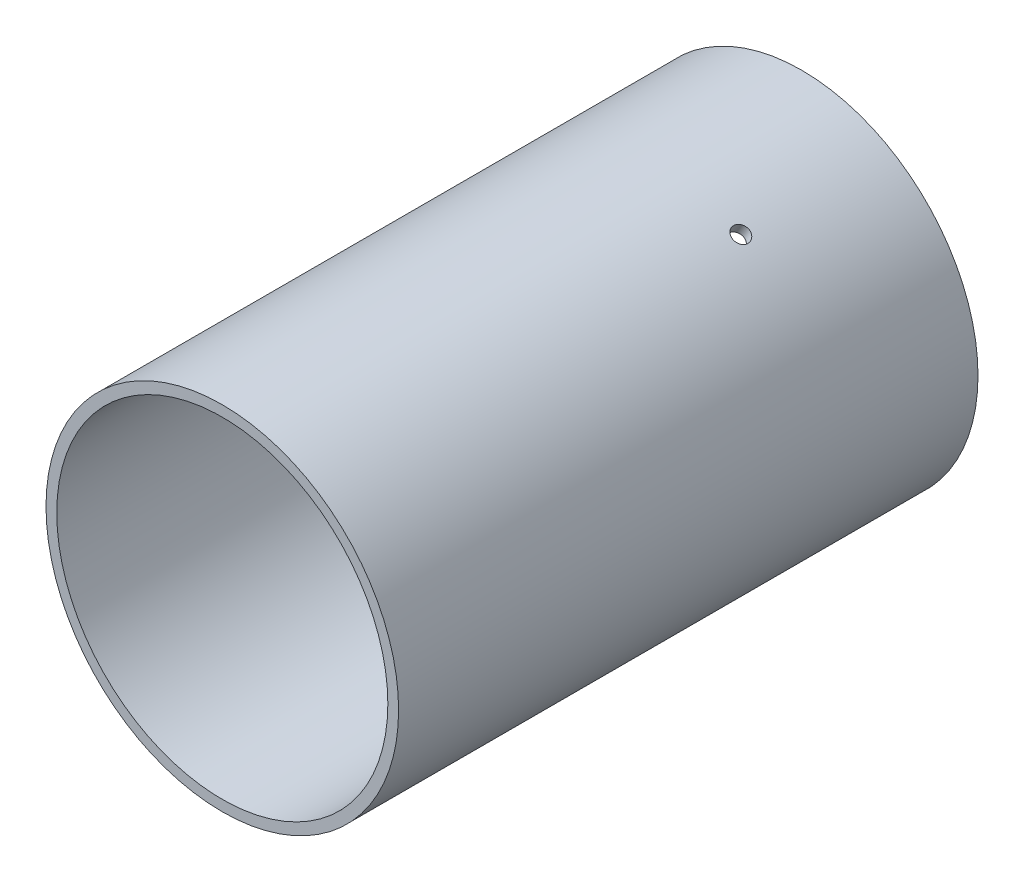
from build123d import *

# Parameters (mm, degrees)
SKETCH1_R          = 27.051
SKETCH1_R_2        = 25.4
EXTRUDE1_DEPTH     = 88.9
SKETCH2_R          = 1.27
CUT_EXTRUDE1_DEPTH = 97.781833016
SKETCH7_R          = 1.27
CUT_EXTRUDE2_DEPTH = 97.781833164
SKETCH8_R          = 1.27
CUT_EXTRUDE3_DEPTH = 97.781833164


with BuildPart() as part:
    # Sketch1 → Extrude1 (new body)
    with BuildSketch(Plane.XY):
        Circle(SKETCH1_R)
        Circle(SKETCH1_R_2, mode=Mode.SUBTRACT)
    extrude(amount=EXTRUDE1_DEPTH)

    # Sketch2 → Cut-Extrude1 (cut, through all)
    with BuildSketch(Plane(origin=(0, 0, 0), x_dir=(0, 0, -1), z_dir=(1, 0, 0))):
        with Locations((-22.86, 0)):
            Circle(SKETCH2_R)
    extrude(amount=-CUT_EXTRUDE1_DEPTH, mode=Mode.SUBTRACT)

    # Sketch7 → Cut-Extrude2 (cut, through all)
    with BuildSketch(Plane(origin=(0, 0, 0), x_dir=(-0.8660254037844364, -0.5000000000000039, 0), z_dir=(-0.5000000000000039, 0.8660254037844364, 0))):
        with Locations((0, 22.86)):
            Circle(SKETCH7_R)
    extrude(amount=-CUT_EXTRUDE2_DEPTH, mode=Mode.SUBTRACT)

    # Sketch8 → Cut-Extrude3 (cut, through all)
    with BuildSketch(Plane(origin=(0, 0, 0), x_dir=(0.8660254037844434, -0.49999999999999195, 0), z_dir=(-0.49999999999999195, -0.8660254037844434, 0))):
        with Locations((0, 22.86)):
            Circle(SKETCH8_R)
    extrude(amount=-CUT_EXTRUDE3_DEPTH, mode=Mode.SUBTRACT)


solid = part.part
